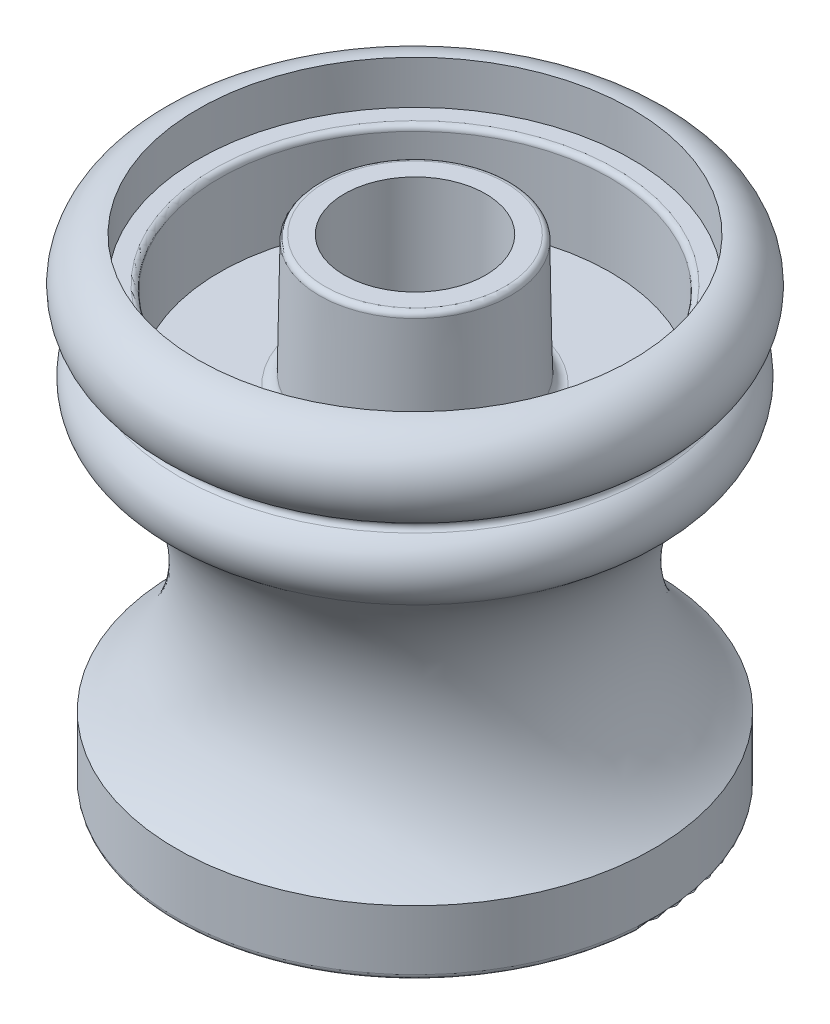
from build123d import *

# Parameters (mm, degrees)
COUNTERSUNK_HOLE_D           = 9
COUNTERSUNK_HOLE_DEPTH       = 12
COUNTERSUNK_HOLE_CSINK_D     = 12
COUNTERSUNK_HOLE_CSINK_ANGLE = 140
SKETCH2_R                    = 10
CUT_EXTRUDE1_DEPTH           = 2
SKETCH3_R                    = 9
CUT_EXTRUDE2_DEPTH           = 4
SKETCH4_R                    = 4.5
BOSS_EXTRUDE1_DEPTH          = 6
BOSS_EXTRUDE1_TAPER          = 1
SKETCH5_R                    = 3.25
CUT_EXTRUDE3_DEPTH           = 28.784888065
FILLET1_R                    = 0.25
FILLET2_R                    = 0.5


with BuildPart() as part:
    # Sketch1 → Base-Revolve (revolve)
    with BuildSketch(Plane.XY, mode=Mode.PRIVATE) as base_revolve_sk:
        with BuildLine():
            Line((0, 0), (11, 0))
            Line((11, 0), (11, 3))
            ThreePointArc((11, 3), (8, 9), (11, 15))
            ThreePointArc((11, 15), (11.664435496, 16.419543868), (10.856896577, 17.76284585))
            ThreePointArc((10.856896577, 17.76284585), (10.735665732, 17.988102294), (10.875938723, 18.202020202))
            ThreePointArc((10.875938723, 18.202020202), (11.948840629, 20.449466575), (10, 22))
            Line((10, 22), (0, 22))
            Line((0, 22), (0, 0))
        make_face()
    revolve(base_revolve_sk.sketch.rotate(Axis((0, 0, 0), (0, 1, 0)), 90), axis=Axis((0, 0, 0), (0, 1, 0)))

    # CounterSunk Hole
    with Locations(Plane.XZ):
        with Locations((0, 0)):
            CounterSinkHole(COUNTERSUNK_HOLE_D / 2, COUNTERSUNK_HOLE_CSINK_D / 2, depth=COUNTERSUNK_HOLE_DEPTH, counter_sink_angle=COUNTERSUNK_HOLE_CSINK_ANGLE)

    # Sketch2 → Cut-Extrude1 (cut)
    with BuildSketch(Plane(origin=(0, 22, 0), x_dir=(-1, 0, 0), z_dir=(0, 1, 0))):
        with Locations(Location((0, 0, 0), (0, 0, 90))):
            Circle(SKETCH2_R)
    extrude(amount=-CUT_EXTRUDE1_DEPTH, mode=Mode.SUBTRACT)

    # Sketch3 → Cut-Extrude2 (cut)
    with BuildSketch(Plane(origin=(0, 20, 0), x_dir=(-1, 0, 0), z_dir=(0, 1, 0))):
        with Locations(Location((0, 0, 0), (0, 0, 90))):
            Circle(SKETCH3_R)
    extrude(amount=-CUT_EXTRUDE2_DEPTH, mode=Mode.SUBTRACT)

    # Sketch4 → Boss-Extrude1 (add)
    with BuildSketch(Plane(origin=(0, 16, 0), x_dir=(-1, 0, 0), z_dir=(0, 1, 0))):
        with Locations(Location((0, 0, 0), (0, 0, 270))):
            Circle(SKETCH4_R)
    extrude(amount=BOSS_EXTRUDE1_DEPTH, taper=BOSS_EXTRUDE1_TAPER)

    # Sketch5 → Cut-Extrude3 (cut, through all)
    with BuildSketch(Plane(origin=(0, 22, 0), x_dir=(-1, 0, 0), z_dir=(0, 1, 0))):
        with Locations(Location((0, 0, 0), (0, 0, 90))):
            Circle(SKETCH5_R)
    extrude(amount=-CUT_EXTRUDE3_DEPTH, mode=Mode.SUBTRACT)

    # Fillet1
    fillet1_edges = [part.edges().sort_by_distance(p)[0] for p in [
        (0, 20, -9),
        (0, 22, 4.39526961),
        (0, 0, 11),
    ]]
    fillet(fillet1_edges, radius=FILLET1_R)

    # Fillet2
    fillet2_edges = [part.edges().sort_by_distance(p)[0] for p in [
        (0, 16, 4.5),
    ]]
    fillet(fillet2_edges, radius=FILLET2_R)


solid = part.part
